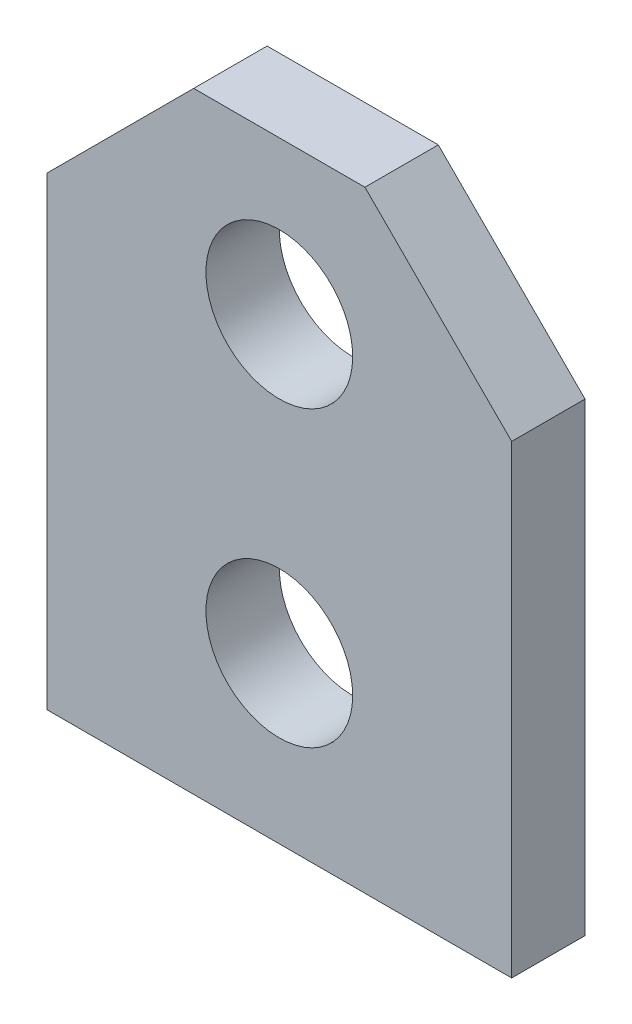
ISO-10303-21;
HEADER;
FILE_DESCRIPTION(('STEP AP214'),'2;1');
FILE_NAME('part.step','',(''),(''),'','','');
FILE_SCHEMA(('AUTOMOTIVE_DESIGN { 1 0 10303 214 1 1 1 1 }'));
ENDSEC;
DATA;
#1=APPLICATION_CONTEXT('core data for automotive mechanical design processes');
#2=APPLICATION_PROTOCOL_DEFINITION('international standard','automotive_design',2000,#1);
#3=PRODUCT_CONTEXT('',#1,'mechanical');
#4=PRODUCT('Part','Part','',(#3));
#5=PRODUCT_RELATED_PRODUCT_CATEGORY('part','',(#4));
#6=PRODUCT_DEFINITION_FORMATION('','',#4);
#7=PRODUCT_DEFINITION_CONTEXT('part definition',#1,'design');
#8=PRODUCT_DEFINITION('design','',#6,#7);
#9=PRODUCT_DEFINITION_SHAPE('','',#8);
#10=(LENGTH_UNIT() NAMED_UNIT(*) SI_UNIT(.MILLI.,.METRE.));
#11=(NAMED_UNIT(*) PLANE_ANGLE_UNIT() SI_UNIT($,.RADIAN.));
#12=(NAMED_UNIT(*) SI_UNIT($,.STERADIAN.) SOLID_ANGLE_UNIT());
#13=UNCERTAINTY_MEASURE_WITH_UNIT(LENGTH_MEASURE(1.E-05),#10,'distance_accuracy_value','');
#14=(GEOMETRIC_REPRESENTATION_CONTEXT(3) GLOBAL_UNCERTAINTY_ASSIGNED_CONTEXT((#13)) GLOBAL_UNIT_ASSIGNED_CONTEXT((#10,
#11,#12)) REPRESENTATION_CONTEXT('',''));
#15=CARTESIAN_POINT('',(0.,0.,0.));
#16=DIRECTION('',(0.,0.,1.));
#17=DIRECTION('',(1.,0.,0.));
#18=AXIS2_PLACEMENT_3D('',#15,#16,#17);
#19=CARTESIAN_POINT('',(0.,0.,1.524));
#20=DIRECTION('',(1.,0.,0.));
#21=DIRECTION('',(0.,0.,-1.));
#22=AXIS2_PLACEMENT_3D('',#19,#20,#21);
#23=PLANE('',#22);
#24=DIRECTION('',(0.,-1.,0.));
#25=VECTOR('',#24,1.);
#26=CARTESIAN_POINT('',(0.,0.,1.524));
#27=LINE('',#26,#25);
#28=CARTESIAN_POINT('',(0.,9.65199999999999,1.524));
#29=VERTEX_POINT('',#28);
#30=CARTESIAN_POINT('',(0.,0.,1.524));
#31=VERTEX_POINT('',#30);
#32=EDGE_CURVE('E136',#29,#31,#27,.T.);
#33=ORIENTED_EDGE('',*,*,#32,.F.);
#34=DIRECTION('',(0.,0.,-1.));
#35=VECTOR('',#34,1.);
#36=CARTESIAN_POINT('',(0.,9.652,1.524));
#37=LINE('',#36,#35);
#38=CARTESIAN_POINT('',(0.,9.65199999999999,0.));
#39=VERTEX_POINT('',#38);
#40=EDGE_CURVE('E11',#29,#39,#37,.T.);
#41=ORIENTED_EDGE('',*,*,#40,.T.);
#42=DIRECTION('',(0.,-1.,0.));
#43=VECTOR('',#42,1.);
#44=CARTESIAN_POINT('',(0.,0.,0.));
#45=LINE('',#44,#43);
#46=CARTESIAN_POINT('',(0.,0.,0.));
#47=VERTEX_POINT('',#46);
#48=EDGE_CURVE('E86',#39,#47,#45,.T.);
#49=ORIENTED_EDGE('',*,*,#48,.T.);
#50=DIRECTION('',(0.,0.,-1.));
#51=VECTOR('',#50,1.);
#52=CARTESIAN_POINT('',(0.,0.,1.524));
#53=LINE('',#52,#51);
#54=EDGE_CURVE('E89',#31,#47,#53,.T.);
#55=ORIENTED_EDGE('',*,*,#54,.F.);
#56=EDGE_LOOP('',(#33,#41,#49,#55));
#57=FACE_BOUND('',#56,.T.);
#58=ADVANCED_FACE('F31',(#57),#23,.F.);
#59=CARTESIAN_POINT('',(0.,0.,1.524));
#60=DIRECTION('',(0.,1.,0.));
#61=DIRECTION('',(0.,0.,1.));
#62=AXIS2_PLACEMENT_3D('',#59,#60,#61);
#63=PLANE('',#62);
#64=DIRECTION('',(1.,0.,0.));
#65=VECTOR('',#64,1.);
#66=CARTESIAN_POINT('',(0.,0.,0.));
#67=LINE('',#66,#65);
#68=CARTESIAN_POINT('',(9.652,0.,0.));
#69=VERTEX_POINT('',#68);
#70=EDGE_CURVE('E92',#47,#69,#67,.T.);
#71=ORIENTED_EDGE('',*,*,#70,.T.);
#72=DIRECTION('',(0.,0.,-1.));
#73=VECTOR('',#72,1.);
#74=CARTESIAN_POINT('',(9.652,0.,1.524));
#75=LINE('',#74,#73);
#76=CARTESIAN_POINT('',(9.652,0.,1.524));
#77=VERTEX_POINT('',#76);
#78=EDGE_CURVE('E107',#77,#69,#75,.T.);
#79=ORIENTED_EDGE('',*,*,#78,.F.);
#80=DIRECTION('',(1.,0.,0.));
#81=VECTOR('',#80,1.);
#82=CARTESIAN_POINT('',(0.,0.,1.524));
#83=LINE('',#82,#81);
#84=EDGE_CURVE('E105',#31,#77,#83,.T.);
#85=ORIENTED_EDGE('',*,*,#84,.F.);
#86=ORIENTED_EDGE('',*,*,#54,.T.);
#87=EDGE_LOOP('',(#71,#79,#85,#86));
#88=FACE_BOUND('',#87,.T.);
#89=ADVANCED_FACE('F104',(#88),#63,.F.);
#90=CARTESIAN_POINT('',(9.652,0.,1.524));
#91=DIRECTION('',(-1.,0.,0.));
#92=DIRECTION('',(0.,0.,1.));
#93=AXIS2_PLACEMENT_3D('',#90,#91,#92);
#94=PLANE('',#93);
#95=DIRECTION('',(0.,1.,0.));
#96=VECTOR('',#95,1.);
#97=CARTESIAN_POINT('',(9.652,0.,0.));
#98=LINE('',#97,#96);
#99=CARTESIAN_POINT('',(9.652,9.65199999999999,0.));
#100=VERTEX_POINT('',#99);
#101=EDGE_CURVE('E98',#69,#100,#98,.T.);
#102=ORIENTED_EDGE('',*,*,#101,.T.);
#103=DIRECTION('',(0.,0.,1.));
#104=VECTOR('',#103,1.);
#105=CARTESIAN_POINT('',(9.652,9.65199999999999,1.524));
#106=LINE('',#105,#104);
#107=CARTESIAN_POINT('',(9.652,9.65199999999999,1.524));
#108=VERTEX_POINT('',#107);
#109=EDGE_CURVE('E53',#100,#108,#106,.T.);
#110=ORIENTED_EDGE('',*,*,#109,.T.);
#111=DIRECTION('',(0.,1.,0.));
#112=VECTOR('',#111,1.);
#113=CARTESIAN_POINT('',(9.652,0.,1.524));
#114=LINE('',#113,#112);
#115=EDGE_CURVE('E125',#77,#108,#114,.T.);
#116=ORIENTED_EDGE('',*,*,#115,.F.);
#117=ORIENTED_EDGE('',*,*,#78,.T.);
#118=EDGE_LOOP('',(#102,#110,#116,#117));
#119=FACE_BOUND('',#118,.T.);
#120=ADVANCED_FACE('F134',(#119),#94,.F.);
#121=CARTESIAN_POINT('',(0.,12.7,1.524));
#122=DIRECTION('',(0.,-1.,0.));
#123=DIRECTION('',(0.,0.,-1.));
#124=AXIS2_PLACEMENT_3D('',#121,#122,#123);
#125=PLANE('',#124);
#126=DIRECTION('',(-1.,0.,0.));
#127=VECTOR('',#126,1.);
#128=CARTESIAN_POINT('',(0.,12.7,1.524));
#129=LINE('',#128,#127);
#130=CARTESIAN_POINT('',(6.604,12.7,1.524));
#131=VERTEX_POINT('',#130);
#132=CARTESIAN_POINT('',(3.04800000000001,12.7,1.524));
#133=VERTEX_POINT('',#132);
#134=EDGE_CURVE('E111',#131,#133,#129,.T.);
#135=ORIENTED_EDGE('',*,*,#134,.F.);
#136=DIRECTION('',(0.,0.,-1.));
#137=VECTOR('',#136,1.);
#138=CARTESIAN_POINT('',(6.604,12.7,1.524));
#139=LINE('',#138,#137);
#140=CARTESIAN_POINT('',(6.604,12.7,0.));
#141=VERTEX_POINT('',#140);
#142=EDGE_CURVE('E109',#131,#141,#139,.T.);
#143=ORIENTED_EDGE('',*,*,#142,.T.);
#144=DIRECTION('',(-1.,0.,0.));
#145=VECTOR('',#144,1.);
#146=CARTESIAN_POINT('',(0.,12.7,0.));
#147=LINE('',#146,#145);
#148=CARTESIAN_POINT('',(3.04800000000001,12.7,0.));
#149=VERTEX_POINT('',#148);
#150=EDGE_CURVE('E133',#141,#149,#147,.T.);
#151=ORIENTED_EDGE('',*,*,#150,.T.);
#152=DIRECTION('',(0.,0.,1.));
#153=VECTOR('',#152,1.);
#154=CARTESIAN_POINT('',(3.04800000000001,12.7,1.524));
#155=LINE('',#154,#153);
#156=EDGE_CURVE('E106',#149,#133,#155,.T.);
#157=ORIENTED_EDGE('',*,*,#156,.T.);
#158=EDGE_LOOP('',(#135,#143,#151,#157));
#159=FACE_BOUND('',#158,.T.);
#160=ADVANCED_FACE('F129',(#159),#125,.F.);
#161=CARTESIAN_POINT('',(0.,12.7,1.524));
#162=DIRECTION('',(0.,0.,-1.));
#163=DIRECTION('',(-1.,0.,0.));
#164=AXIS2_PLACEMENT_3D('',#161,#162,#163);
#165=PLANE('',#164);
#166=CARTESIAN_POINT('',(4.826,3.429,1.524));
#167=DIRECTION('',(0.,0.,1.));
#168=DIRECTION('',(1.,0.,0.));
#169=AXIS2_PLACEMENT_3D('',#166,#167,#168);
#170=CIRCLE('',#169,1.524);
#171=CARTESIAN_POINT('',(6.35,3.429,1.524));
#172=VERTEX_POINT('',#171);
#173=EDGE_CURVE('E181',#172,#172,#170,.T.);
#174=ORIENTED_EDGE('',*,*,#173,.F.);
#175=EDGE_LOOP('',(#174));
#176=FACE_BOUND('',#175,.T.);
#177=CARTESIAN_POINT('',(4.826,9.525,1.524));
#178=DIRECTION('',(0.,0.,1.));
#179=DIRECTION('',(1.,0.,0.));
#180=AXIS2_PLACEMENT_3D('',#177,#178,#179);
#181=CIRCLE('',#180,1.524);
#182=CARTESIAN_POINT('',(6.35,9.525,1.524));
#183=VERTEX_POINT('',#182);
#184=EDGE_CURVE('E183',#183,#183,#181,.T.);
#185=ORIENTED_EDGE('',*,*,#184,.F.);
#186=EDGE_LOOP('',(#185));
#187=FACE_BOUND('',#186,.T.);
#188=ORIENTED_EDGE('',*,*,#115,.T.);
#189=DIRECTION('',(0.707106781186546,-0.707106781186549,0.));
#190=VECTOR('',#189,1.);
#191=CARTESIAN_POINT('',(6.604,12.7,1.524));
#192=LINE('',#191,#190);
#193=EDGE_CURVE('E38',#108,#131,#192,.F.);
#194=ORIENTED_EDGE('',*,*,#193,.T.);
#195=ORIENTED_EDGE('',*,*,#134,.T.);
#196=DIRECTION('',(0.707106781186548,0.707106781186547,0.));
#197=VECTOR('',#196,1.);
#198=CARTESIAN_POINT('',(0.,9.652,1.524));
#199=LINE('',#198,#197);
#200=EDGE_CURVE('E45',#133,#29,#199,.F.);
#201=ORIENTED_EDGE('',*,*,#200,.T.);
#202=ORIENTED_EDGE('',*,*,#32,.T.);
#203=ORIENTED_EDGE('',*,*,#84,.T.);
#204=EDGE_LOOP('',(#188,#194,#195,#201,#202,#203));
#205=FACE_BOUND('',#204,.T.);
#206=ADVANCED_FACE('F124',(#176,#187,#205),#165,.F.);
#207=CARTESIAN_POINT('',(0.,12.7,0.));
#208=DIRECTION('',(0.,0.,-1.));
#209=DIRECTION('',(-1.,0.,0.));
#210=AXIS2_PLACEMENT_3D('',#207,#208,#209);
#211=PLANE('',#210);
#212=CARTESIAN_POINT('',(4.826,3.429,0.));
#213=DIRECTION('',(0.,0.,1.));
#214=DIRECTION('',(1.,0.,0.));
#215=AXIS2_PLACEMENT_3D('',#212,#213,#214);
#216=CIRCLE('',#215,1.524);
#217=CARTESIAN_POINT('',(6.35,3.429,0.));
#218=VERTEX_POINT('',#217);
#219=EDGE_CURVE('E178',#218,#218,#216,.T.);
#220=ORIENTED_EDGE('',*,*,#219,.T.);
#221=EDGE_LOOP('',(#220));
#222=FACE_BOUND('',#221,.T.);
#223=CARTESIAN_POINT('',(4.826,9.525,0.));
#224=DIRECTION('',(0.,0.,1.));
#225=DIRECTION('',(1.,0.,0.));
#226=AXIS2_PLACEMENT_3D('',#223,#224,#225);
#227=CIRCLE('',#226,1.524);
#228=CARTESIAN_POINT('',(6.35,9.525,0.));
#229=VERTEX_POINT('',#228);
#230=EDGE_CURVE('E93',#229,#229,#227,.T.);
#231=ORIENTED_EDGE('',*,*,#230,.T.);
#232=EDGE_LOOP('',(#231));
#233=FACE_BOUND('',#232,.T.);
#234=ORIENTED_EDGE('',*,*,#150,.F.);
#235=DIRECTION('',(-0.707106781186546,0.707106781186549,0.));
#236=VECTOR('',#235,1.);
#237=CARTESIAN_POINT('',(3.30200000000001,16.002,0.));
#238=LINE('',#237,#236);
#239=EDGE_CURVE('E119',#141,#100,#238,.F.);
#240=ORIENTED_EDGE('',*,*,#239,.T.);
#241=ORIENTED_EDGE('',*,*,#101,.F.);
#242=ORIENTED_EDGE('',*,*,#70,.F.);
#243=ORIENTED_EDGE('',*,*,#48,.F.);
#244=DIRECTION('',(-0.707106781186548,-0.707106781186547,0.));
#245=VECTOR('',#244,1.);
#246=CARTESIAN_POINT('',(1.524,11.176,0.));
#247=LINE('',#246,#245);
#248=EDGE_CURVE('E117',#39,#149,#247,.F.);
#249=ORIENTED_EDGE('',*,*,#248,.T.);
#250=EDGE_LOOP('',(#234,#240,#241,#242,#243,#249));
#251=FACE_BOUND('',#250,.T.);
#252=ADVANCED_FACE('F97',(#222,#233,#251),#211,.T.);
#253=CARTESIAN_POINT('',(4.826,9.525,0.));
#254=DIRECTION('',(0.,0.,1.));
#255=DIRECTION('',(1.,0.,0.));
#256=AXIS2_PLACEMENT_3D('',#253,#254,#255);
#257=CYLINDRICAL_SURFACE('',#256,1.524);
#258=CARTESIAN_POINT('',(6.35,9.525,0.));
#259=CARTESIAN_POINT('',(6.35,9.525,0.015875));
#260=CARTESIAN_POINT('',(6.35,9.525,0.03175));
#261=CARTESIAN_POINT('',(6.35,9.525,0.0635));
#262=CARTESIAN_POINT('',(6.35,9.525,0.079375));
#263=CARTESIAN_POINT('',(6.35,9.525,0.111125));
#264=CARTESIAN_POINT('',(6.35,9.525,0.127));
#265=CARTESIAN_POINT('',(6.35,9.525,0.15875));
#266=CARTESIAN_POINT('',(6.35,9.525,0.174625));
#267=CARTESIAN_POINT('',(6.35,9.525,0.206375));
#268=CARTESIAN_POINT('',(6.35,9.525,0.22225));
#269=CARTESIAN_POINT('',(6.35,9.525,0.254));
#270=CARTESIAN_POINT('',(6.35,9.525,0.269875));
#271=CARTESIAN_POINT('',(6.35,9.525,0.301625));
#272=CARTESIAN_POINT('',(6.35,9.525,0.3175));
#273=CARTESIAN_POINT('',(6.35,9.525,0.34925));
#274=CARTESIAN_POINT('',(6.35,9.525,0.365125));
#275=CARTESIAN_POINT('',(6.35,9.525,0.396875));
#276=CARTESIAN_POINT('',(6.35,9.525,0.41275));
#277=CARTESIAN_POINT('',(6.35,9.525,0.4445));
#278=CARTESIAN_POINT('',(6.35,9.525,0.460375));
#279=CARTESIAN_POINT('',(6.35,9.525,0.492125));
#280=CARTESIAN_POINT('',(6.35,9.525,0.508));
#281=CARTESIAN_POINT('',(6.35,9.525,0.53975));
#282=CARTESIAN_POINT('',(6.35,9.525,0.555625));
#283=CARTESIAN_POINT('',(6.35,9.525,0.587375));
#284=CARTESIAN_POINT('',(6.35,9.525,0.60325));
#285=CARTESIAN_POINT('',(6.35,9.525,0.635));
#286=CARTESIAN_POINT('',(6.35,9.525,0.650875));
#287=CARTESIAN_POINT('',(6.35,9.525,0.682625));
#288=CARTESIAN_POINT('',(6.35,9.525,0.6985));
#289=CARTESIAN_POINT('',(6.35,9.525,0.73025));
#290=CARTESIAN_POINT('',(6.35,9.525,0.746125));
#291=CARTESIAN_POINT('',(6.35,9.525,0.777875));
#292=CARTESIAN_POINT('',(6.35,9.525,0.79375));
#293=CARTESIAN_POINT('',(6.35,9.525,0.8255));
#294=CARTESIAN_POINT('',(6.35,9.525,0.841375));
#295=CARTESIAN_POINT('',(6.35,9.525,0.873125));
#296=CARTESIAN_POINT('',(6.35,9.525,0.889));
#297=CARTESIAN_POINT('',(6.35,9.525,0.92075));
#298=CARTESIAN_POINT('',(6.35,9.525,0.936625));
#299=CARTESIAN_POINT('',(6.35,9.525,0.968375));
#300=CARTESIAN_POINT('',(6.35,9.525,0.98425));
#301=CARTESIAN_POINT('',(6.35,9.525,1.016));
#302=CARTESIAN_POINT('',(6.35,9.525,1.031875));
#303=CARTESIAN_POINT('',(6.35,9.525,1.063625));
#304=CARTESIAN_POINT('',(6.35,9.525,1.0795));
#305=CARTESIAN_POINT('',(6.35,9.525,1.11125));
#306=CARTESIAN_POINT('',(6.35,9.525,1.127125));
#307=CARTESIAN_POINT('',(6.35,9.525,1.158875));
#308=CARTESIAN_POINT('',(6.35,9.525,1.17475));
#309=CARTESIAN_POINT('',(6.35,9.525,1.2065));
#310=CARTESIAN_POINT('',(6.35,9.525,1.222375));
#311=CARTESIAN_POINT('',(6.35,9.525,1.254125));
#312=CARTESIAN_POINT('',(6.35,9.525,1.27));
#313=CARTESIAN_POINT('',(6.35,9.525,1.30175));
#314=CARTESIAN_POINT('',(6.35,9.525,1.317625));
#315=CARTESIAN_POINT('',(6.35,9.525,1.349375));
#316=CARTESIAN_POINT('',(6.35,9.525,1.36525));
#317=CARTESIAN_POINT('',(6.35,9.525,1.397));
#318=CARTESIAN_POINT('',(6.35,9.525,1.412875));
#319=CARTESIAN_POINT('',(6.35,9.525,1.444625));
#320=CARTESIAN_POINT('',(6.35,9.525,1.4605));
#321=CARTESIAN_POINT('',(6.35,9.525,1.49225));
#322=CARTESIAN_POINT('',(6.35,9.525,1.508125));
#323=CARTESIAN_POINT('',(6.35,9.525,1.524));
#324=B_SPLINE_CURVE_WITH_KNOTS('',3,(#258,#259,#260,#261,#262,#263,#264,#265,#266,#267,#268,
#269,#270,#271,#272,#273,#274,#275,#276,#277,#278,#279,#280,#281,#282,#283,#284,#285,#286,#287,
#288,#289,#290,#291,#292,#293,#294,#295,#296,#297,#298,#299,#300,#301,#302,#303,#304,#305,#306,
#307,#308,#309,#310,#311,#312,#313,#314,#315,#316,#317,#318,#319,#320,#321,#322,#323),
.UNSPECIFIED.,.F.,.F.,(4,2,2,2,2,2,2,2,2,2,2,2,2,2,2,2,2,2,2,2,2,2,2,2,2,2,2,2,2,2,2,2,4),(0.,
0.047625,0.09525,0.142875,0.1905,0.238125,0.28575,0.333375,0.381,0.428625,0.47625,0.523875,
0.5715,0.619125,0.66675,0.714375,0.762,0.809625,0.85725,0.904875,0.9525,1.000125,1.04775,
1.095375,1.143,1.190625,1.23825,1.285875,1.3335,1.381125,1.42875,1.476375,1.524),.UNSPECIFIED.);
#325=EDGE_CURVE('BSEAM166',#229,#183,#324,.T.);
#326=ORIENTED_EDGE('',*,*,#230,.F.);
#327=ORIENTED_EDGE('',*,*,#184,.T.);
#328=ORIENTED_EDGE('',*,*,#325,.T.);
#329=ORIENTED_EDGE('',*,*,#325,.F.);
#330=EDGE_LOOP('',(#326,#328,#327,#329));
#331=FACE_BOUND('',#330,.T.);
#332=ADVANCED_FACE('F166',(#331),#257,.F.);
#333=CARTESIAN_POINT('',(4.826,3.429,0.));
#334=DIRECTION('',(0.,0.,1.));
#335=DIRECTION('',(1.,0.,0.));
#336=AXIS2_PLACEMENT_3D('',#333,#334,#335);
#337=CYLINDRICAL_SURFACE('',#336,1.524);
#338=CARTESIAN_POINT('',(6.35,3.429,0.));
#339=CARTESIAN_POINT('',(6.35,3.429,0.015875));
#340=CARTESIAN_POINT('',(6.35,3.429,0.03175));
#341=CARTESIAN_POINT('',(6.35,3.429,0.0635));
#342=CARTESIAN_POINT('',(6.35,3.429,0.079375));
#343=CARTESIAN_POINT('',(6.35,3.429,0.111125));
#344=CARTESIAN_POINT('',(6.35,3.429,0.127));
#345=CARTESIAN_POINT('',(6.35,3.429,0.15875));
#346=CARTESIAN_POINT('',(6.35,3.429,0.174625));
#347=CARTESIAN_POINT('',(6.35,3.429,0.206375));
#348=CARTESIAN_POINT('',(6.35,3.429,0.22225));
#349=CARTESIAN_POINT('',(6.35,3.429,0.254));
#350=CARTESIAN_POINT('',(6.35,3.429,0.269875));
#351=CARTESIAN_POINT('',(6.35,3.429,0.301625));
#352=CARTESIAN_POINT('',(6.35,3.429,0.3175));
#353=CARTESIAN_POINT('',(6.35,3.429,0.34925));
#354=CARTESIAN_POINT('',(6.35,3.429,0.365125));
#355=CARTESIAN_POINT('',(6.35,3.429,0.396875));
#356=CARTESIAN_POINT('',(6.35,3.429,0.41275));
#357=CARTESIAN_POINT('',(6.35,3.429,0.4445));
#358=CARTESIAN_POINT('',(6.35,3.429,0.460375));
#359=CARTESIAN_POINT('',(6.35,3.429,0.492125));
#360=CARTESIAN_POINT('',(6.35,3.429,0.508));
#361=CARTESIAN_POINT('',(6.35,3.429,0.53975));
#362=CARTESIAN_POINT('',(6.35,3.429,0.555625));
#363=CARTESIAN_POINT('',(6.35,3.429,0.587375));
#364=CARTESIAN_POINT('',(6.35,3.429,0.60325));
#365=CARTESIAN_POINT('',(6.35,3.429,0.635));
#366=CARTESIAN_POINT('',(6.35,3.429,0.650875));
#367=CARTESIAN_POINT('',(6.35,3.429,0.682625));
#368=CARTESIAN_POINT('',(6.35,3.429,0.6985));
#369=CARTESIAN_POINT('',(6.35,3.429,0.73025));
#370=CARTESIAN_POINT('',(6.35,3.429,0.746125));
#371=CARTESIAN_POINT('',(6.35,3.429,0.777875));
#372=CARTESIAN_POINT('',(6.35,3.429,0.79375));
#373=CARTESIAN_POINT('',(6.35,3.429,0.8255));
#374=CARTESIAN_POINT('',(6.35,3.429,0.841375));
#375=CARTESIAN_POINT('',(6.35,3.429,0.873125));
#376=CARTESIAN_POINT('',(6.35,3.429,0.889));
#377=CARTESIAN_POINT('',(6.35,3.429,0.92075));
#378=CARTESIAN_POINT('',(6.35,3.429,0.936625));
#379=CARTESIAN_POINT('',(6.35,3.429,0.968375));
#380=CARTESIAN_POINT('',(6.35,3.429,0.98425));
#381=CARTESIAN_POINT('',(6.35,3.429,1.016));
#382=CARTESIAN_POINT('',(6.35,3.429,1.031875));
#383=CARTESIAN_POINT('',(6.35,3.429,1.063625));
#384=CARTESIAN_POINT('',(6.35,3.429,1.0795));
#385=CARTESIAN_POINT('',(6.35,3.429,1.11125));
#386=CARTESIAN_POINT('',(6.35,3.429,1.127125));
#387=CARTESIAN_POINT('',(6.35,3.429,1.158875));
#388=CARTESIAN_POINT('',(6.35,3.429,1.17475));
#389=CARTESIAN_POINT('',(6.35,3.429,1.2065));
#390=CARTESIAN_POINT('',(6.35,3.429,1.222375));
#391=CARTESIAN_POINT('',(6.35,3.429,1.254125));
#392=CARTESIAN_POINT('',(6.35,3.429,1.27));
#393=CARTESIAN_POINT('',(6.35,3.429,1.30175));
#394=CARTESIAN_POINT('',(6.35,3.429,1.317625));
#395=CARTESIAN_POINT('',(6.35,3.429,1.349375));
#396=CARTESIAN_POINT('',(6.35,3.429,1.36525));
#397=CARTESIAN_POINT('',(6.35,3.429,1.397));
#398=CARTESIAN_POINT('',(6.35,3.429,1.412875));
#399=CARTESIAN_POINT('',(6.35,3.429,1.444625));
#400=CARTESIAN_POINT('',(6.35,3.429,1.4605));
#401=CARTESIAN_POINT('',(6.35,3.429,1.49225));
#402=CARTESIAN_POINT('',(6.35,3.429,1.508125));
#403=CARTESIAN_POINT('',(6.35,3.429,1.524));
#404=B_SPLINE_CURVE_WITH_KNOTS('',3,(#338,#339,#340,#341,#342,#343,#344,#345,#346,#347,#348,
#349,#350,#351,#352,#353,#354,#355,#356,#357,#358,#359,#360,#361,#362,#363,#364,#365,#366,#367,
#368,#369,#370,#371,#372,#373,#374,#375,#376,#377,#378,#379,#380,#381,#382,#383,#384,#385,#386,
#387,#388,#389,#390,#391,#392,#393,#394,#395,#396,#397,#398,#399,#400,#401,#402,#403),
.UNSPECIFIED.,.F.,.F.,(4,2,2,2,2,2,2,2,2,2,2,2,2,2,2,2,2,2,2,2,2,2,2,2,2,2,2,2,2,2,2,2,4),(0.,
0.047625,0.09525,0.142875,0.1905,0.238125,0.28575,0.333375,0.381,0.428625,0.47625,0.523875,
0.5715,0.619125,0.66675,0.714375,0.762,0.809625,0.85725,0.904875,0.9525,1.000125,1.04775,
1.095375,1.143,1.190625,1.23825,1.285875,1.3335,1.381125,1.42875,1.476375,1.524),.UNSPECIFIED.);
#405=EDGE_CURVE('BSEAM148',#218,#172,#404,.T.);
#406=ORIENTED_EDGE('',*,*,#219,.F.);
#407=ORIENTED_EDGE('',*,*,#173,.T.);
#408=ORIENTED_EDGE('',*,*,#405,.T.);
#409=ORIENTED_EDGE('',*,*,#405,.F.);
#410=EDGE_LOOP('',(#406,#408,#407,#409));
#411=FACE_BOUND('',#410,.T.);
#412=ADVANCED_FACE('F148',(#411),#337,.F.);
#413=CARTESIAN_POINT('',(6.604,12.7,1.524));
#414=DIRECTION('',(-0.707106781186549,-0.707106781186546,0.));
#415=DIRECTION('',(0.707106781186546,-0.707106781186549,0.));
#416=AXIS2_PLACEMENT_3D('',#413,#414,#415);
#417=PLANE('',#416);
#418=ORIENTED_EDGE('',*,*,#193,.F.);
#419=ORIENTED_EDGE('',*,*,#109,.F.);
#420=ORIENTED_EDGE('',*,*,#239,.F.);
#421=ORIENTED_EDGE('',*,*,#142,.F.);
#422=EDGE_LOOP('',(#418,#419,#420,#421));
#423=FACE_BOUND('',#422,.T.);
#424=ADVANCED_FACE('F132',(#423),#417,.F.);
#425=CARTESIAN_POINT('',(0.,9.652,1.524));
#426=DIRECTION('',(0.707106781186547,-0.707106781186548,0.));
#427=DIRECTION('',(0.707106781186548,0.707106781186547,0.));
#428=AXIS2_PLACEMENT_3D('',#425,#426,#427);
#429=PLANE('',#428);
#430=ORIENTED_EDGE('',*,*,#200,.F.);
#431=ORIENTED_EDGE('',*,*,#156,.F.);
#432=ORIENTED_EDGE('',*,*,#248,.F.);
#433=ORIENTED_EDGE('',*,*,#40,.F.);
#434=EDGE_LOOP('',(#430,#431,#432,#433));
#435=FACE_BOUND('',#434,.T.);
#436=ADVANCED_FACE('F142',(#435),#429,.F.);
#437=CLOSED_SHELL('',(#58,#89,#120,#160,#206,#252,#332,#412,#424,#436));
#438=MANIFOLD_SOLID_BREP('B2',#437);
#439=ADVANCED_BREP_SHAPE_REPRESENTATION('',(#18,#438),#14);
#440=SHAPE_DEFINITION_REPRESENTATION(#9,#439);
ENDSEC;
END-ISO-10303-21;
